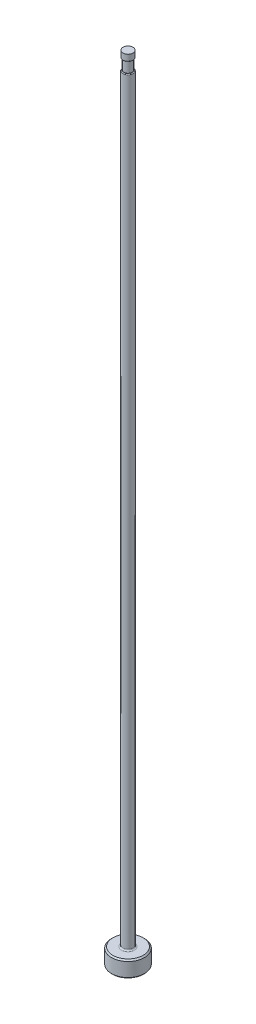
ISO-10303-21;
HEADER;
FILE_DESCRIPTION(('STEP AP214'),'2;1');
FILE_NAME('part.step','',(''),(''),'','','');
FILE_SCHEMA(('AUTOMOTIVE_DESIGN { 1 0 10303 214 1 1 1 1 }'));
ENDSEC;
DATA;
#1=APPLICATION_CONTEXT('core data for automotive mechanical design processes');
#2=APPLICATION_PROTOCOL_DEFINITION('international standard','automotive_design',2000,#1);
#3=PRODUCT_CONTEXT('',#1,'mechanical');
#4=PRODUCT('Part','Part','',(#3));
#5=PRODUCT_RELATED_PRODUCT_CATEGORY('part','',(#4));
#6=PRODUCT_DEFINITION_FORMATION('','',#4);
#7=PRODUCT_DEFINITION_CONTEXT('part definition',#1,'design');
#8=PRODUCT_DEFINITION('design','',#6,#7);
#9=PRODUCT_DEFINITION_SHAPE('','',#8);
#10=(LENGTH_UNIT() NAMED_UNIT(*) SI_UNIT(.MILLI.,.METRE.));
#11=(NAMED_UNIT(*) PLANE_ANGLE_UNIT() SI_UNIT($,.RADIAN.));
#12=(NAMED_UNIT(*) SI_UNIT($,.STERADIAN.) SOLID_ANGLE_UNIT());
#13=UNCERTAINTY_MEASURE_WITH_UNIT(LENGTH_MEASURE(1.E-05),#10,'distance_accuracy_value','');
#14=(GEOMETRIC_REPRESENTATION_CONTEXT(3) GLOBAL_UNCERTAINTY_ASSIGNED_CONTEXT((#13)) GLOBAL_UNIT_ASSIGNED_CONTEXT((#10,
#11,#12)) REPRESENTATION_CONTEXT('',''));
#15=CARTESIAN_POINT('',(0.,0.,0.));
#16=DIRECTION('',(0.,0.,1.));
#17=DIRECTION('',(1.,0.,0.));
#18=AXIS2_PLACEMENT_3D('',#15,#16,#17);
#19=CARTESIAN_POINT('',(-0.991869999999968,151.13,0.));
#20=DIRECTION('',(0.,1.,0.));
#21=DIRECTION('',(0.,0.,1.));
#22=AXIS2_PLACEMENT_3D('',#19,#20,#21);
#23=PLANE('',#22);
#24=CARTESIAN_POINT('',(0.,151.13,0.));
#25=DIRECTION('',(0.,1.,0.));
#26=DIRECTION('',(0.,0.,1.));
#27=AXIS2_PLACEMENT_3D('',#24,#25,#26);
#28=CIRCLE('',#27,0.845819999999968);
#29=CARTESIAN_POINT('',(0.,151.13,0.845819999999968));
#30=VERTEX_POINT('',#29);
#31=EDGE_CURVE('E11',#30,#30,#28,.F.);
#32=ORIENTED_EDGE('',*,*,#31,.T.);
#33=EDGE_LOOP('',(#32));
#34=FACE_BOUND('',#33,.T.);
#35=CARTESIAN_POINT('',(0.,151.13,0.));
#36=DIRECTION('',(0.,1.,0.));
#37=DIRECTION('',(0.,0.,1.));
#38=AXIS2_PLACEMENT_3D('',#35,#36,#37);
#39=CIRCLE('',#38,0.788669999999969);
#40=CARTESIAN_POINT('',(0.,151.13,0.788669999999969));
#41=VERTEX_POINT('',#40);
#42=EDGE_CURVE('E78',#41,#41,#39,.T.);
#43=ORIENTED_EDGE('',*,*,#42,.T.);
#44=EDGE_LOOP('',(#43));
#45=FACE_BOUND('',#44,.T.);
#46=ADVANCED_FACE('F36',(#34,#45),#23,.F.);
#47=CARTESIAN_POINT('',(0.,259.958771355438,0.));
#48=DIRECTION('',(0.,1.,0.));
#49=DIRECTION('',(0.,0.,1.));
#50=AXIS2_PLACEMENT_3D('',#47,#48,#49);
#51=CYLINDRICAL_SURFACE('',#50,0.991869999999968);
#52=DIRECTION('',(0.,1.,0.));
#53=VECTOR('',#52,1.);
#54=CARTESIAN_POINT('',(-0.788669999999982,259.958771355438,-0.601502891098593));
#55=LINE('',#54,#53);
#56=CARTESIAN_POINT('',(-0.788669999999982,148.971,-0.601502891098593));
#57=VERTEX_POINT('',#56);
#58=CARTESIAN_POINT('',(-0.788669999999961,86.614,-0.601502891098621));
#59=VERTEX_POINT('',#58);
#60=EDGE_CURVE('E73',#57,#59,#55,.F.);
#61=ORIENTED_EDGE('',*,*,#60,.F.);
#62=CARTESIAN_POINT('',(0.,148.971,0.));
#63=DIRECTION('',(0.,-1.,0.));
#64=DIRECTION('',(0.,0.,-1.));
#65=AXIS2_PLACEMENT_3D('',#62,#63,#64);
#66=CIRCLE('',#65,0.991869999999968);
#67=CARTESIAN_POINT('',(-0.788669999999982,148.971,0.601502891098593));
#68=VERTEX_POINT('',#67);
#69=EDGE_CURVE('E51',#57,#68,#66,.T.);
#70=ORIENTED_EDGE('',*,*,#69,.T.);
#71=DIRECTION('',(0.,1.,0.));
#72=VECTOR('',#71,1.);
#73=CARTESIAN_POINT('',(-0.788669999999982,259.958771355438,0.601502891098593));
#74=LINE('',#73,#72);
#75=CARTESIAN_POINT('',(-0.788669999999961,86.614,0.601502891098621));
#76=VERTEX_POINT('',#75);
#77=EDGE_CURVE('E84',#76,#68,#74,.T.);
#78=ORIENTED_EDGE('',*,*,#77,.F.);
#79=CARTESIAN_POINT('',(-0.78866999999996,86.614,-0.601502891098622));
#80=CARTESIAN_POINT('',(-0.788666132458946,86.5723657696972,-0.601487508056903));
#81=CARTESIAN_POINT('',(-0.789488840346,86.5307268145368,-0.600428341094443));
#82=CARTESIAN_POINT('',(-0.792762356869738,86.4475772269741,-0.596110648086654));
#83=CARTESIAN_POINT('',(-0.795215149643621,86.4060668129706,-0.5928494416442));
#84=CARTESIAN_POINT('',(-0.801750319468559,86.3230760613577,-0.583979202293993));
#85=CARTESIAN_POINT('',(-0.80584587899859,86.2815987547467,-0.578351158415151));
#86=CARTESIAN_POINT('',(-0.815598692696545,86.1992848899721,-0.564514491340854));
#87=CARTESIAN_POINT('',(-0.821255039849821,86.1584479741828,-0.556307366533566));
#88=CARTESIAN_POINT('',(-0.835799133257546,86.0664854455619,-0.534292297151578));
#89=CARTESIAN_POINT('',(-0.845147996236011,86.015646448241,-0.51956237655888));
#90=CARTESIAN_POINT('',(-0.865829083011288,85.9164630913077,-0.484320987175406));
#91=CARTESIAN_POINT('',(-0.877157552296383,85.868114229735,-0.463820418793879));
#92=CARTESIAN_POINT('',(-0.898053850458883,85.787005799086,-0.421558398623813));
#93=CARTESIAN_POINT('',(-0.907358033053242,85.7533614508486,-0.401380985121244));
#94=CARTESIAN_POINT('',(-0.926056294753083,85.6895419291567,-0.356125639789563));
#95=CARTESIAN_POINT('',(-0.935450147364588,85.6593597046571,-0.331057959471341));
#96=CARTESIAN_POINT('',(-0.950231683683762,85.6139121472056,-0.285005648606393));
#97=CARTESIAN_POINT('',(-0.955876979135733,85.5971082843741,-0.265630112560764));
#98=CARTESIAN_POINT('',(-0.966384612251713,85.5665435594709,-0.224405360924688));
#99=CARTESIAN_POINT('',(-0.971247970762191,85.5527787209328,-0.202559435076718));
#100=CARTESIAN_POINT('',(-0.978947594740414,85.5313348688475,-0.16073053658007));
#101=CARTESIAN_POINT('',(-0.981991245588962,85.5230060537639,-0.141121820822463));
#102=CARTESIAN_POINT('',(-0.986954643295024,85.5095350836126,-0.100697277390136));
#103=CARTESIAN_POINT('',(-0.988875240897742,85.5043905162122,-0.0798823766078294));
#104=CARTESIAN_POINT('',(-0.991389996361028,85.4976710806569,-0.0374802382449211));
#105=CARTESIAN_POINT('',(-0.991977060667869,85.4961153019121,-0.0158894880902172));
#106=CARTESIAN_POINT('',(-0.991730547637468,85.4967708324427,0.0272258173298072));
#107=CARTESIAN_POINT('',(-0.990897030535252,85.4989819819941,0.0487503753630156));
#108=CARTESIAN_POINT('',(-0.988037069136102,85.5066392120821,0.0892607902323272));
#109=CARTESIAN_POINT('',(-0.986115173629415,85.511802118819,0.108309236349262));
#110=CARTESIAN_POINT('',(-0.98134109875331,85.5247860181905,0.145344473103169));
#111=CARTESIAN_POINT('',(-0.978488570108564,85.5326080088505,0.163330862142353));
#112=CARTESIAN_POINT('',(-0.970708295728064,85.5542895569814,0.205331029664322));
#113=CARTESIAN_POINT('',(-0.96541298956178,85.5693036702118,0.228680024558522));
#114=CARTESIAN_POINT('',(-0.953964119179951,85.6027581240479,0.272534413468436));
#115=CARTESIAN_POINT('',(-0.947808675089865,85.6212059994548,0.293033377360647));
#116=CARTESIAN_POINT('',(-0.931801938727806,85.6709271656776,0.341318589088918));
#117=CARTESIAN_POINT('',(-0.921702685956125,85.7038591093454,0.367302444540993));
#118=CARTESIAN_POINT('',(-0.901756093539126,85.7733884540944,0.413864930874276));
#119=CARTESIAN_POINT('',(-0.891909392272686,85.8099941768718,0.434430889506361));
#120=CARTESIAN_POINT('',(-0.874578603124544,85.8796825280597,0.468207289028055));
#121=CARTESIAN_POINT('',(-0.866965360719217,85.9124263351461,0.482064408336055));
#122=CARTESIAN_POINT('',(-0.852602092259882,85.97913810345,0.507032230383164));
#123=CARTESIAN_POINT('',(-0.845852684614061,86.0131069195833,0.518140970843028));
#124=CARTESIAN_POINT('',(-0.827119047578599,86.1164444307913,0.547946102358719));
#125=CARTESIAN_POINT('',(-0.816676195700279,86.1871386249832,0.56307398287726));
#126=CARTESIAN_POINT('',(-0.801997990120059,86.317402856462,0.583716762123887));
#127=CARTESIAN_POINT('',(-0.796987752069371,86.3767084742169,0.590464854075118));
#128=CARTESIAN_POINT('',(-0.791992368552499,86.4658069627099,0.597127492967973));
#129=CARTESIAN_POINT('',(-0.790747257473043,86.4954091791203,0.598772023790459));
#130=CARTESIAN_POINT('',(-0.789085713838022,86.5546736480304,0.600958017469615));
#131=CARTESIAN_POINT('',(-0.788669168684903,86.5843358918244,0.601499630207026));
#132=CARTESIAN_POINT('',(-0.788669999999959,86.614,0.601502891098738));
#133=B_SPLINE_CURVE_WITH_KNOTS('',3,(#79,#80,#81,#82,#83,#84,#85,#86,#87,#88,#89,#90,#91,#92,
#93,#94,#95,#96,#97,#98,#99,#100,#101,#102,#103,#104,#105,#106,#107,#108,#109,#110,#111,#112,
#113,#114,#115,#116,#117,#118,#119,#120,#121,#122,#123,#124,#125,#126,#127,#128,#129,#130,#131,
#132),.UNSPECIFIED.,.F.,.F.,(4,2,2,2,2,2,2,2,2,2,2,2,2,2,2,2,2,2,2,2,2,2,2,2,2,2,4),(0.,
0.124888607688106,0.249929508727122,0.375994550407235,0.501986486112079,0.662910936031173,
0.823533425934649,0.944174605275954,1.06456554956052,1.14311274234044,1.22155654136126,
1.28585720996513,1.350109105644,1.41470198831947,1.47929213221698,1.53853130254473,
1.59779273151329,1.68209646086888,1.76658740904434,1.89530637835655,2.02432379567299,
2.13325396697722,2.24226168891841,2.46062960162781,2.64005592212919,2.72904839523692,
2.81802877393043),.UNSPECIFIED.);
#134=EDGE_CURVE('E81',#59,#76,#133,.T.);
#135=ORIENTED_EDGE('',*,*,#134,.F.);
#136=EDGE_LOOP('',(#61,#70,#78,#135));
#137=FACE_BOUND('',#136,.T.);
#138=CARTESIAN_POINT('',(0.,3.42900000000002,0.));
#139=DIRECTION('',(0.,1.,0.));
#140=DIRECTION('',(0.,0.,1.));
#141=AXIS2_PLACEMENT_3D('',#138,#139,#140);
#142=CIRCLE('',#141,0.991869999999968);
#143=CARTESIAN_POINT('',(0.,3.42900000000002,0.991869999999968));
#144=VERTEX_POINT('',#143);
#145=EDGE_CURVE('E116',#144,#144,#142,.T.);
#146=ORIENTED_EDGE('',*,*,#145,.T.);
#147=EDGE_LOOP('',(#146));
#148=FACE_BOUND('',#147,.T.);
#149=ADVANCED_FACE('F82',(#137,#148),#51,.T.);
#150=CARTESIAN_POINT('',(0.,0.,0.));
#151=DIRECTION('',(0.,-1.,0.));
#152=DIRECTION('',(0.,0.,-1.));
#153=AXIS2_PLACEMENT_3D('',#150,#151,#152);
#154=PLANE('',#153);
#155=CARTESIAN_POINT('',(0.,0.,0.));
#156=DIRECTION('',(0.,-1.,0.));
#157=DIRECTION('',(0.,0.,-1.));
#158=AXIS2_PLACEMENT_3D('',#155,#156,#157);
#159=CIRCLE('',#158,2.92099999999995);
#160=CARTESIAN_POINT('',(0.,0.,-2.92099999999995));
#161=VERTEX_POINT('',#160);
#162=EDGE_CURVE('E113',#161,#161,#159,.T.);
#163=ORIENTED_EDGE('',*,*,#162,.T.);
#164=EDGE_LOOP('',(#163));
#165=FACE_BOUND('',#164,.T.);
#166=ADVANCED_FACE('F192',(#165),#154,.T.);
#167=CARTESIAN_POINT('',(0.,259.958771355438,0.));
#168=DIRECTION('',(0.,1.,0.));
#169=DIRECTION('',(0.,0.,1.));
#170=AXIS2_PLACEMENT_3D('',#167,#168,#169);
#171=CYLINDRICAL_SURFACE('',#170,3.17499999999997);
#172=CARTESIAN_POINT('',(0.,2.92100000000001,0.));
#173=DIRECTION('',(0.,1.,0.));
#174=DIRECTION('',(0.,0.,1.));
#175=AXIS2_PLACEMENT_3D('',#172,#173,#174);
#176=CIRCLE('',#175,3.17499999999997);
#177=CARTESIAN_POINT('',(0.,2.92100000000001,3.17499999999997));
#178=VERTEX_POINT('',#177);
#179=EDGE_CURVE('E110',#178,#178,#176,.F.);
#180=ORIENTED_EDGE('',*,*,#179,.T.);
#181=EDGE_LOOP('',(#180));
#182=FACE_BOUND('',#181,.T.);
#183=CARTESIAN_POINT('',(0.,0.254000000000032,0.));
#184=DIRECTION('',(0.,-1.,0.));
#185=DIRECTION('',(0.,0.,-1.));
#186=AXIS2_PLACEMENT_3D('',#183,#184,#185);
#187=CIRCLE('',#186,3.17499999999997);
#188=CARTESIAN_POINT('',(0.,0.254000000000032,-3.17499999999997));
#189=VERTEX_POINT('',#188);
#190=EDGE_CURVE('E107',#189,#189,#187,.F.);
#191=ORIENTED_EDGE('',*,*,#190,.T.);
#192=EDGE_LOOP('',(#191));
#193=FACE_BOUND('',#192,.T.);
#194=ADVANCED_FACE('F195',(#182,#193),#171,.T.);
#195=CARTESIAN_POINT('',(-3.17499999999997,3.175,0.));
#196=DIRECTION('',(0.,1.,0.));
#197=DIRECTION('',(0.,0.,1.));
#198=AXIS2_PLACEMENT_3D('',#195,#196,#197);
#199=PLANE('',#198);
#200=CARTESIAN_POINT('',(0.,3.175,0.));
#201=DIRECTION('',(0.,1.,0.));
#202=DIRECTION('',(0.,0.,1.));
#203=AXIS2_PLACEMENT_3D('',#200,#201,#202);
#204=CIRCLE('',#203,1.24586999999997);
#205=CARTESIAN_POINT('',(0.,3.175,1.24586999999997));
#206=VERTEX_POINT('',#205);
#207=EDGE_CURVE('E87',#206,#206,#204,.F.);
#208=ORIENTED_EDGE('',*,*,#207,.T.);
#209=EDGE_LOOP('',(#208));
#210=FACE_BOUND('',#209,.T.);
#211=CARTESIAN_POINT('',(0.,3.175,0.));
#212=DIRECTION('',(0.,1.,0.));
#213=DIRECTION('',(0.,0.,1.));
#214=AXIS2_PLACEMENT_3D('',#211,#212,#213);
#215=CIRCLE('',#214,2.92099999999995);
#216=CARTESIAN_POINT('',(0.,3.175,2.92099999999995));
#217=VERTEX_POINT('',#216);
#218=EDGE_CURVE('E104',#217,#217,#215,.T.);
#219=ORIENTED_EDGE('',*,*,#218,.T.);
#220=EDGE_LOOP('',(#219));
#221=FACE_BOUND('',#220,.T.);
#222=ADVANCED_FACE('F190',(#210,#221),#199,.T.);
#223=CARTESIAN_POINT('',(0.,3.17499999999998,0.));
#224=DIRECTION('',(0.,-1.,0.));
#225=DIRECTION('',(0.,0.,-1.));
#226=AXIS2_PLACEMENT_3D('',#223,#224,#225);
#227=CONICAL_SURFACE('',#226,2.92099999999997,0.7853981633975);
#228=ORIENTED_EDGE('',*,*,#179,.F.);
#229=EDGE_LOOP('',(#228));
#230=FACE_BOUND('',#229,.T.);
#231=ORIENTED_EDGE('',*,*,#218,.F.);
#232=EDGE_LOOP('',(#231));
#233=FACE_BOUND('',#232,.T.);
#234=ADVANCED_FACE('F186',(#230,#233),#227,.T.);
#235=CARTESIAN_POINT('',(0.,0.254000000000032,0.));
#236=DIRECTION('',(0.,1.,0.));
#237=DIRECTION('',(0.,0.,1.));
#238=AXIS2_PLACEMENT_3D('',#235,#236,#237);
#239=CONICAL_SURFACE('',#238,3.17499999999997,0.785398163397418);
#240=ORIENTED_EDGE('',*,*,#162,.F.);
#241=EDGE_LOOP('',(#240));
#242=FACE_BOUND('',#241,.T.);
#243=ORIENTED_EDGE('',*,*,#190,.F.);
#244=EDGE_LOOP('',(#243));
#245=FACE_BOUND('',#244,.T.);
#246=ADVANCED_FACE('F182',(#242,#245),#239,.T.);
#247=CARTESIAN_POINT('',(0.,3.42900000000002,0.));
#248=DIRECTION('',(0.,1.,0.));
#249=DIRECTION('',(0.,0.,1.));
#250=AXIS2_PLACEMENT_3D('',#247,#248,#249);
#251=TOROIDAL_SURFACE('',#250,1.24586999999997,0.254);
#252=ORIENTED_EDGE('',*,*,#207,.F.);
#253=EDGE_LOOP('',(#252));
#254=FACE_BOUND('',#253,.T.);
#255=ORIENTED_EDGE('',*,*,#145,.F.);
#256=EDGE_LOOP('',(#255));
#257=FACE_BOUND('',#256,.T.);
#258=ADVANCED_FACE('F147',(#254,#257),#251,.F.);
#259=CARTESIAN_POINT('',(-0.991869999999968,149.098,0.));
#260=DIRECTION('',(0.,-1.,0.));
#261=DIRECTION('',(0.,0.,-1.));
#262=AXIS2_PLACEMENT_3D('',#259,#260,#261);
#263=PLANE('',#262);
#264=DIRECTION('',(0.,0.,1.));
#265=VECTOR('',#264,1.);
#266=CARTESIAN_POINT('',(-0.788669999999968,149.098,0.));
#267=LINE('',#266,#265);
#268=CARTESIAN_POINT('',(-0.788669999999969,149.098,0.));
#269=VERTEX_POINT('',#268);
#270=CARTESIAN_POINT('',(-0.788669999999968,149.098,0.354964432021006));
#271=VERTEX_POINT('',#270);
#272=EDGE_CURVE('E90',#269,#271,#267,.T.);
#273=ORIENTED_EDGE('',*,*,#272,.T.);
#274=CARTESIAN_POINT('',(0.,149.098,0.));
#275=DIRECTION('',(0.,-1.,0.));
#276=DIRECTION('',(0.,0.,-1.));
#277=AXIS2_PLACEMENT_3D('',#274,#275,#276);
#278=CIRCLE('',#277,0.864869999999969);
#279=CARTESIAN_POINT('',(-0.788669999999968,149.098,-0.354964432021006));
#280=VERTEX_POINT('',#279);
#281=EDGE_CURVE('E86',#271,#280,#278,.F.);
#282=ORIENTED_EDGE('',*,*,#281,.T.);
#283=EDGE_CURVE('E79',#280,#269,#267,.T.);
#284=ORIENTED_EDGE('',*,*,#283,.T.);
#285=CARTESIAN_POINT('',(0.,149.098,0.));
#286=DIRECTION('',(0.,1.,0.));
#287=DIRECTION('',(0.,0.,1.));
#288=AXIS2_PLACEMENT_3D('',#285,#286,#287);
#289=CIRCLE('',#288,0.788669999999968);
#290=EDGE_CURVE('E101',#269,#269,#289,.T.);
#291=ORIENTED_EDGE('',*,*,#290,.F.);
#292=EDGE_LOOP('',(#273,#282,#284,#291));
#293=FACE_BOUND('',#292,.T.);
#294=ADVANCED_FACE('F144',(#293),#263,.F.);
#295=CARTESIAN_POINT('',(0.,153.448281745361,0.));
#296=DIRECTION('',(0.,1.,0.));
#297=DIRECTION('',(0.,0.,1.));
#298=AXIS2_PLACEMENT_3D('',#295,#296,#297);
#299=CYLINDRICAL_SURFACE('',#298,0.788669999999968);
#300=ORIENTED_EDGE('',*,*,#42,.F.);
#301=EDGE_LOOP('',(#300));
#302=FACE_BOUND('',#301,.T.);
#303=ORIENTED_EDGE('',*,*,#290,.T.);
#304=EDGE_LOOP('',(#303));
#305=FACE_BOUND('',#304,.T.);
#306=ADVANCED_FACE('F141',(#302,#305),#299,.T.);
#307=CARTESIAN_POINT('',(-0.788669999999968,150.114,-3.17499999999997));
#308=DIRECTION('',(1.,0.,0.));
#309=DIRECTION('',(0.,1.,0.));
#310=AXIS2_PLACEMENT_3D('',#307,#308,#309);
#311=PLANE('',#310);
#312=ORIENTED_EDGE('',*,*,#283,.F.);
#313=CARTESIAN_POINT('',(-0.788669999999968,149.098,-0.354964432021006));
#314=CARTESIAN_POINT('',(-0.788669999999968,149.097991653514,-0.368137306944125));
#315=CARTESIAN_POINT('',(-0.788669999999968,149.097653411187,-0.381328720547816));
#316=CARTESIAN_POINT('',(-0.788669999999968,149.096063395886,-0.40778985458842));
#317=CARTESIAN_POINT('',(-0.788669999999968,149.094802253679,-0.421058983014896));
#318=CARTESIAN_POINT('',(-0.788669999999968,149.091062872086,-0.447724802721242));
#319=CARTESIAN_POINT('',(-0.788669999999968,149.088559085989,-0.461118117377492));
#320=CARTESIAN_POINT('',(-0.788669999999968,149.081968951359,-0.487472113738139));
#321=CARTESIAN_POINT('',(-0.788669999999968,149.077890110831,-0.500434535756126));
#322=CARTESIAN_POINT('',(-0.788669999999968,149.070061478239,-0.519670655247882));
#323=CARTESIAN_POINT('',(-0.788669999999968,149.06704648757,-0.526242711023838));
#324=CARTESIAN_POINT('',(-0.788669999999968,149.060344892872,-0.53902776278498));
#325=CARTESIAN_POINT('',(-0.788669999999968,149.056659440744,-0.545241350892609));
#326=CARTESIAN_POINT('',(-0.788669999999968,149.048480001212,-0.557211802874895));
#327=CARTESIAN_POINT('',(-0.788669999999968,149.043978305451,-0.56296348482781));
#328=CARTESIAN_POINT('',(-0.788669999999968,149.034105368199,-0.573676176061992));
#329=CARTESIAN_POINT('',(-0.788669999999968,149.028735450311,-0.578638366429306));
#330=CARTESIAN_POINT('',(-0.788669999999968,149.018914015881,-0.586040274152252));
#331=CARTESIAN_POINT('',(-0.788669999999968,149.014693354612,-0.588785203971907));
#332=CARTESIAN_POINT('',(-0.788669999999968,149.005874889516,-0.593566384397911));
#333=CARTESIAN_POINT('',(-0.788669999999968,149.001278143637,-0.595604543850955));
#334=CARTESIAN_POINT('',(-0.788669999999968,148.99244552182,-0.598606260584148));
#335=CARTESIAN_POINT('',(-0.788669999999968,148.988247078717,-0.599679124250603));
#336=CARTESIAN_POINT('',(-0.788669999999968,148.97970249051,-0.60113386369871));
#337=CARTESIAN_POINT('',(-0.788669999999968,148.975355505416,-0.601510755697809));
#338=CARTESIAN_POINT('',(-0.788669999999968,148.971,-0.601502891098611));
#339=B_SPLINE_CURVE_WITH_KNOTS('',3,(#313,#314,#315,#316,#317,#318,#319,#320,#321,#322,#323,
#324,#325,#326,#327,#328,#329,#330,#331,#332,#333,#334,#335,#336,#337,#338),.UNSPECIFIED.,.F.,
.F.,(4,2,2,2,2,2,2,2,2,2,2,2,4),(0.,0.039543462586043,0.0794940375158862,0.120302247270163,
0.160918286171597,0.182579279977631,0.204203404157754,0.226043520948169,0.247850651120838,
0.262901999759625,0.27791237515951,0.290856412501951,0.303892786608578),.UNSPECIFIED.);
#340=EDGE_CURVE('E59',#280,#57,#339,.T.);
#341=ORIENTED_EDGE('',*,*,#340,.T.);
#342=ORIENTED_EDGE('',*,*,#60,.T.);
#343=DIRECTION('',(0.,0.,1.));
#344=VECTOR('',#343,1.);
#345=CARTESIAN_POINT('',(-0.788669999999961,86.614,-3.17499999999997));
#346=LINE('',#345,#344);
#347=EDGE_CURVE('E77',#59,#76,#346,.T.);
#348=ORIENTED_EDGE('',*,*,#347,.T.);
#349=ORIENTED_EDGE('',*,*,#77,.T.);
#350=CARTESIAN_POINT('',(-0.788669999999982,148.971,0.601502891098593));
#351=CARTESIAN_POINT('',(-0.788669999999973,148.976166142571,0.601517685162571));
#352=CARTESIAN_POINT('',(-0.78866999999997,148.981314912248,0.600984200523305));
#353=CARTESIAN_POINT('',(-0.788669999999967,148.991363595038,0.598952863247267));
#354=CARTESIAN_POINT('',(-0.788669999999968,148.996265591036,0.597465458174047));
#355=CARTESIAN_POINT('',(-0.788669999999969,149.005706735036,0.59366073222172));
#356=CARTESIAN_POINT('',(-0.788669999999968,149.010247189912,0.591346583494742));
#357=CARTESIAN_POINT('',(-0.788669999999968,149.018926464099,0.586045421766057));
#358=CARTESIAN_POINT('',(-0.788669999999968,149.023064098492,0.583056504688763));
#359=CARTESIAN_POINT('',(-0.788669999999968,149.032796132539,0.574987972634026));
#360=CARTESIAN_POINT('',(-0.788669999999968,149.038130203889,0.569595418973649));
#361=CARTESIAN_POINT('',(-0.788669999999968,149.047886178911,0.558050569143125));
#362=CARTESIAN_POINT('',(-0.788669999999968,149.052306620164,0.551897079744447));
#363=CARTESIAN_POINT('',(-0.788669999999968,149.062844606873,0.535097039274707));
#364=CARTESIAN_POINT('',(-0.788669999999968,149.068303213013,0.524040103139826));
#365=CARTESIAN_POINT('',(-0.788669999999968,149.077553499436,0.501210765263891));
#366=CARTESIAN_POINT('',(-0.788669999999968,149.081334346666,0.489434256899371));
#367=CARTESIAN_POINT('',(-0.788669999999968,149.089711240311,0.457304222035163));
#368=CARTESIAN_POINT('',(-0.788669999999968,149.093073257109,0.436633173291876));
#369=CARTESIAN_POINT('',(-0.788669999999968,149.096171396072,0.405739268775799));
#370=CARTESIAN_POINT('',(-0.788669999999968,149.096882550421,0.395580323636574));
#371=CARTESIAN_POINT('',(-0.788669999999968,149.097795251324,0.375270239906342));
#372=CARTESIAN_POINT('',(-0.788669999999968,149.097998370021,0.365119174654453));
#373=CARTESIAN_POINT('',(-0.788669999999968,149.098,0.354964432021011));
#374=B_SPLINE_CURVE_WITH_KNOTS('',3,(#350,#351,#352,#353,#354,#355,#356,#357,#358,#359,#360,
#361,#362,#363,#364,#365,#366,#367,#368,#369,#370,#371,#372,#373),.UNSPECIFIED.,.F.,.F.,(4,2,2,
2,2,2,2,2,2,2,2,4),(0.,0.0154434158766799,0.0307205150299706,0.0459396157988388,
0.0612022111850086,0.0838287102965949,0.106491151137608,0.14327546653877,0.180293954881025,
0.24282537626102,0.273372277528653,0.303824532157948),.UNSPECIFIED.);
#375=EDGE_CURVE('E172',#68,#271,#374,.T.);
#376=ORIENTED_EDGE('',*,*,#375,.T.);
#377=ORIENTED_EDGE('',*,*,#272,.F.);
#378=EDGE_LOOP('',(#312,#341,#342,#348,#349,#376,#377));
#379=FACE_BOUND('',#378,.T.);
#380=ADVANCED_FACE('F75',(#379),#311,.F.);
#381=CARTESIAN_POINT('',(-3.96366999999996,86.614,-3.17499999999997));
#382=DIRECTION('',(0.,0.,1.));
#383=DIRECTION('',(1.,0.,0.));
#384=AXIS2_PLACEMENT_3D('',#381,#382,#383);
#385=CYLINDRICAL_SURFACE('',#384,3.175);
#386=ORIENTED_EDGE('',*,*,#347,.F.);
#387=ORIENTED_EDGE('',*,*,#134,.T.);
#388=EDGE_LOOP('',(#386,#387));
#389=FACE_BOUND('',#388,.T.);
#390=ADVANCED_FACE('F89',(#389),#385,.F.);
#391=CARTESIAN_POINT('',(0.,152.687735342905,0.));
#392=DIRECTION('',(0.,1.,0.));
#393=DIRECTION('',(0.,0.,1.));
#394=AXIS2_PLACEMENT_3D('',#391,#392,#393);
#395=CYLINDRICAL_SURFACE('',#394,0.972819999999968);
#396=CARTESIAN_POINT('',(0.,151.257,0.));
#397=DIRECTION('',(0.,1.,0.));
#398=DIRECTION('',(0.,0.,1.));
#399=AXIS2_PLACEMENT_3D('',#396,#397,#398);
#400=CIRCLE('',#399,0.972819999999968);
#401=CARTESIAN_POINT('',(0.,151.257,0.972819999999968));
#402=VERTEX_POINT('',#401);
#403=EDGE_CURVE('E44',#402,#402,#400,.T.);
#404=ORIENTED_EDGE('',*,*,#403,.T.);
#405=EDGE_LOOP('',(#404));
#406=FACE_BOUND('',#405,.T.);
#407=CARTESIAN_POINT('',(0.,152.4,0.));
#408=DIRECTION('',(0.,1.,0.));
#409=DIRECTION('',(0.,0.,1.));
#410=AXIS2_PLACEMENT_3D('',#407,#408,#409);
#411=CIRCLE('',#410,0.972819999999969);
#412=CARTESIAN_POINT('',(0.,152.4,0.972819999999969));
#413=VERTEX_POINT('',#412);
#414=EDGE_CURVE('E91',#413,#413,#411,.T.);
#415=ORIENTED_EDGE('',*,*,#414,.F.);
#416=EDGE_LOOP('',(#415));
#417=FACE_BOUND('',#416,.T.);
#418=ADVANCED_FACE('F135',(#406,#417),#395,.T.);
#419=CARTESIAN_POINT('',(-0.991869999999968,152.4,0.));
#420=DIRECTION('',(0.,1.,0.));
#421=DIRECTION('',(0.,0.,1.));
#422=AXIS2_PLACEMENT_3D('',#419,#420,#421);
#423=PLANE('',#422);
#424=ORIENTED_EDGE('',*,*,#414,.T.);
#425=EDGE_LOOP('',(#424));
#426=FACE_BOUND('',#425,.T.);
#427=ADVANCED_FACE('F149',(#426),#423,.T.);
#428=CARTESIAN_POINT('',(0.,148.971,0.));
#429=DIRECTION('',(0.,-1.,0.));
#430=DIRECTION('',(0.,0.,-1.));
#431=AXIS2_PLACEMENT_3D('',#428,#429,#430);
#432=TOROIDAL_SURFACE('',#431,0.864869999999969,0.127);
#433=ORIENTED_EDGE('',*,*,#375,.F.);
#434=ORIENTED_EDGE('',*,*,#69,.F.);
#435=ORIENTED_EDGE('',*,*,#340,.F.);
#436=ORIENTED_EDGE('',*,*,#281,.F.);
#437=EDGE_LOOP('',(#433,#434,#435,#436));
#438=FACE_BOUND('',#437,.T.);
#439=ADVANCED_FACE('F151',(#438),#432,.T.);
#440=CARTESIAN_POINT('',(0.,151.257,0.));
#441=DIRECTION('',(0.,1.,0.));
#442=DIRECTION('',(0.,0.,1.));
#443=AXIS2_PLACEMENT_3D('',#440,#441,#442);
#444=TOROIDAL_SURFACE('',#443,0.845819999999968,0.127);
#445=ORIENTED_EDGE('',*,*,#31,.F.);
#446=EDGE_LOOP('',(#445));
#447=FACE_BOUND('',#446,.T.);
#448=ORIENTED_EDGE('',*,*,#403,.F.);
#449=EDGE_LOOP('',(#448));
#450=FACE_BOUND('',#449,.T.);
#451=ADVANCED_FACE('F38',(#447,#450),#444,.T.);
#452=CLOSED_SHELL('',(#46,#149,#166,#194,#222,#234,#246,#258,#294,#306,#380,#390,#418,#427,#439,#451));
#453=MANIFOLD_SOLID_BREP('B2',#452);
#454=ADVANCED_BREP_SHAPE_REPRESENTATION('',(#18,#453),#14);
#455=SHAPE_DEFINITION_REPRESENTATION(#9,#454);
ENDSEC;
END-ISO-10303-21;
